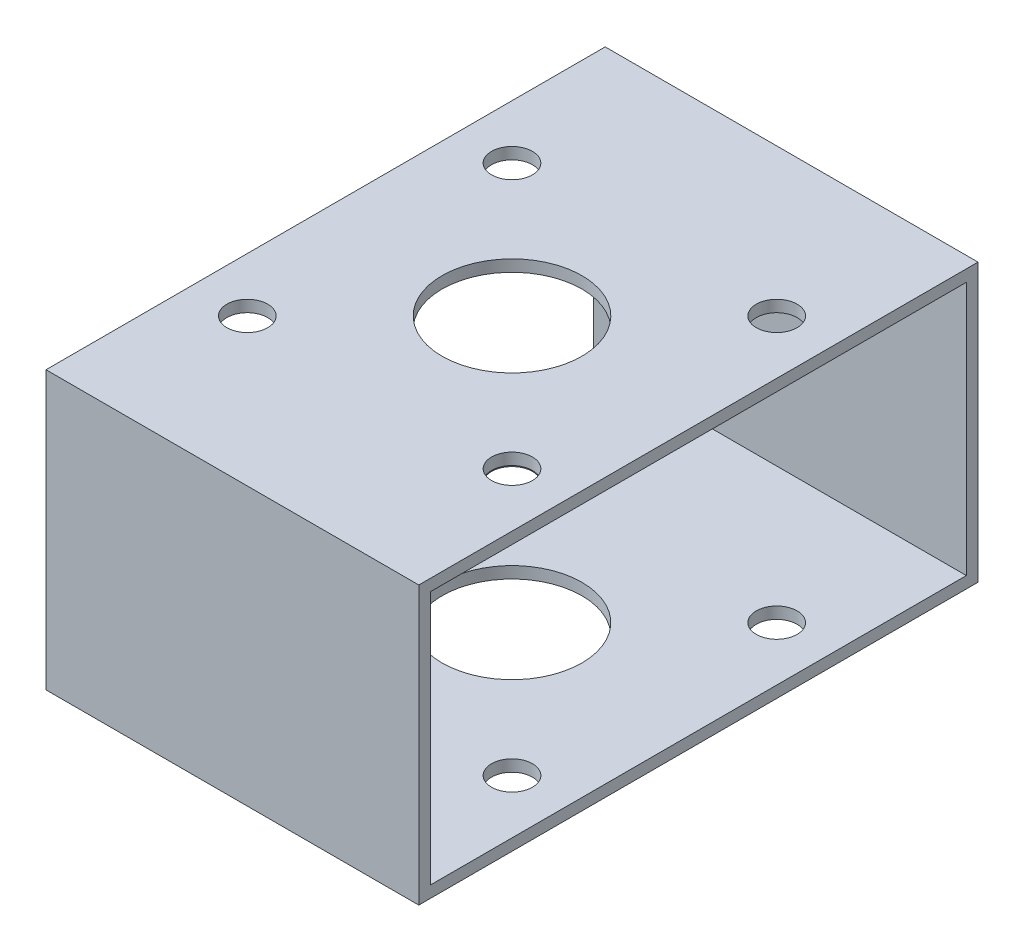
from build123d import *

# Parameters (mm, degrees)
EXTRUDE_THIN1_DEPTH      = 50.8
EXTRUDE_THIN1_DEPTH_BACK = 50.8
SKETCH1_W                = 152.4
SKETCH1_H                = 75.565
SKETCH1_W_2              = 146.05
SKETCH1_H_2              = 69.215
CUT_EXTRUDE1_REACH       = 120.731
SKETCH2_R                = 19.05
SKETCH2_R_2              = 5.5626
CUT_EXTRUDE2_REACH       = 120.731
SKETCH3_R                = 19.05
SKETCH3_R_2              = 5.5626


with BuildPart() as part:
    # Sketch1 → Extrude-Thin1 (new, two sides: drawn at the far end of the back side and taken through both)
    with BuildSketch(Plane(origin=(0, 0, 0), x_dir=(0, 0, -1), z_dir=(1, 0, 0)).offset(-EXTRUDE_THIN1_DEPTH_BACK)):
        Rectangle(SKETCH1_W, SKETCH1_H)
        Rectangle(SKETCH1_W_2, SKETCH1_H_2, mode=Mode.SUBTRACT)
    extrude(amount=EXTRUDE_THIN1_DEPTH + EXTRUDE_THIN1_DEPTH_BACK)

    # Sketch2 → Cut-Extrude1 (cut, up to next)
    with BuildSketch(Plane(origin=(0, 37.7825, 0), x_dir=(-1, 0, 0), z_dir=(0, 1, 0)), mode=Mode.PRIVATE) as cut_extrude1_sk1:
        with Locations(Location((0, 0, 0), (0, 0, 90))):
            Circle(SKETCH2_R)
    cut_extrude1_tool1 = extrude(cut_extrude1_sk1.sketch, amount=-CUT_EXTRUDE1_REACH, mode=Mode.PRIVATE) & part.part
    # Sketch2 → Cut-Extrude1 (cut, up to next)
    with BuildSketch(Plane(origin=(0, 37.7825, 0), x_dir=(-1, 0, 0), z_dir=(0, 1, 0)), mode=Mode.PRIVATE) as cut_extrude1_sk2:
        with Locations(Location((-36.068, 36.068, 0), (0, 0, 90))):
            Circle(SKETCH2_R_2)
    cut_extrude1_tool2 = extrude(cut_extrude1_sk2.sketch, amount=-CUT_EXTRUDE1_REACH, mode=Mode.PRIVATE) & part.part
    # Sketch2 → Cut-Extrude1 (cut, up to next)
    with BuildSketch(Plane(origin=(0, 37.7825, 0), x_dir=(-1, 0, 0), z_dir=(0, 1, 0)), mode=Mode.PRIVATE) as cut_extrude1_sk3:
        with Locations(Location((36.068, 36.068, 0), (0, 0, 90))):
            Circle(SKETCH2_R_2)
    cut_extrude1_tool3 = extrude(cut_extrude1_sk3.sketch, amount=-CUT_EXTRUDE1_REACH, mode=Mode.PRIVATE) & part.part
    # Sketch2 → Cut-Extrude1 (cut, up to next)
    with BuildSketch(Plane(origin=(0, 37.7825, 0), x_dir=(-1, 0, 0), z_dir=(0, 1, 0)), mode=Mode.PRIVATE) as cut_extrude1_sk4:
        with Locations(Location((36.068, -36.068, 0), (0, 0, 90))):
            Circle(SKETCH2_R_2)
    cut_extrude1_tool4 = extrude(cut_extrude1_sk4.sketch, amount=-CUT_EXTRUDE1_REACH, mode=Mode.PRIVATE) & part.part
    # Sketch2 → Cut-Extrude1 (cut, up to next)
    with BuildSketch(Plane(origin=(0, 37.7825, 0), x_dir=(-1, 0, 0), z_dir=(0, 1, 0)), mode=Mode.PRIVATE) as cut_extrude1_sk5:
        with Locations(Location((-36.068, -36.068, 0), (0, 0, 90))):
            Circle(SKETCH2_R_2)
    cut_extrude1_tool5 = extrude(cut_extrude1_sk5.sketch, amount=-CUT_EXTRUDE1_REACH, mode=Mode.PRIVATE) & part.part
    add(cut_extrude1_tool1.solids().sort_by_distance((0, 37.7825, 0))[0], mode=Mode.SUBTRACT)
    add(cut_extrude1_tool2.solids().sort_by_distance((36.068, 37.7825, 36.068))[0], mode=Mode.SUBTRACT)
    add(cut_extrude1_tool3.solids().sort_by_distance((-36.068, 37.7825, 36.068))[0], mode=Mode.SUBTRACT)
    add(cut_extrude1_tool4.solids().sort_by_distance((-36.068, 37.7825, -36.068))[0], mode=Mode.SUBTRACT)
    add(cut_extrude1_tool5.solids().sort_by_distance((36.068, 37.7825, -36.068))[0], mode=Mode.SUBTRACT)

    # Sketch3 → Cut-Extrude2 (cut, up to next)
    with BuildSketch(Plane.XZ.offset(37.7825), mode=Mode.PRIVATE) as cut_extrude2_sk1:
        with Locations(Location((0, 0, 0), (0, 0, 90))):
            Circle(SKETCH3_R)
    cut_extrude2_tool1 = extrude(cut_extrude2_sk1.sketch, amount=-CUT_EXTRUDE2_REACH, mode=Mode.PRIVATE) & part.part
    # Sketch3 → Cut-Extrude2 (cut, up to next)
    with BuildSketch(Plane.XZ.offset(37.7825), mode=Mode.PRIVATE) as cut_extrude2_sk2:
        with Locations(Location((-36.068, 36.068, 0), (0, 0, 90))):
            Circle(SKETCH3_R_2)
    cut_extrude2_tool2 = extrude(cut_extrude2_sk2.sketch, amount=-CUT_EXTRUDE2_REACH, mode=Mode.PRIVATE) & part.part
    # Sketch3 → Cut-Extrude2 (cut, up to next)
    with BuildSketch(Plane.XZ.offset(37.7825), mode=Mode.PRIVATE) as cut_extrude2_sk3:
        with Locations(Location((36.068, 36.068, 0), (0, 0, 90))):
            Circle(SKETCH3_R_2)
    cut_extrude2_tool3 = extrude(cut_extrude2_sk3.sketch, amount=-CUT_EXTRUDE2_REACH, mode=Mode.PRIVATE) & part.part
    # Sketch3 → Cut-Extrude2 (cut, up to next)
    with BuildSketch(Plane.XZ.offset(37.7825), mode=Mode.PRIVATE) as cut_extrude2_sk4:
        with Locations(Location((36.068, -36.068, 0), (0, 0, 90))):
            Circle(SKETCH3_R_2)
    cut_extrude2_tool4 = extrude(cut_extrude2_sk4.sketch, amount=-CUT_EXTRUDE2_REACH, mode=Mode.PRIVATE) & part.part
    # Sketch3 → Cut-Extrude2 (cut, up to next)
    with BuildSketch(Plane.XZ.offset(37.7825), mode=Mode.PRIVATE) as cut_extrude2_sk5:
        with Locations(Location((-36.068, -36.068, 0), (0, 0, 90))):
            Circle(SKETCH3_R_2)
    cut_extrude2_tool5 = extrude(cut_extrude2_sk5.sketch, amount=-CUT_EXTRUDE2_REACH, mode=Mode.PRIVATE) & part.part
    add(cut_extrude2_tool1.solids().sort_by_distance((0, -37.7825, 0))[0], mode=Mode.SUBTRACT)
    add(cut_extrude2_tool2.solids().sort_by_distance((-36.068, -37.7825, 36.068))[0], mode=Mode.SUBTRACT)
    add(cut_extrude2_tool3.solids().sort_by_distance((36.068, -37.7825, 36.068))[0], mode=Mode.SUBTRACT)
    add(cut_extrude2_tool4.solids().sort_by_distance((36.068, -37.7825, -36.068))[0], mode=Mode.SUBTRACT)
    add(cut_extrude2_tool5.solids().sort_by_distance((-36.068, -37.7825, -36.068))[0], mode=Mode.SUBTRACT)


solid = part.part
